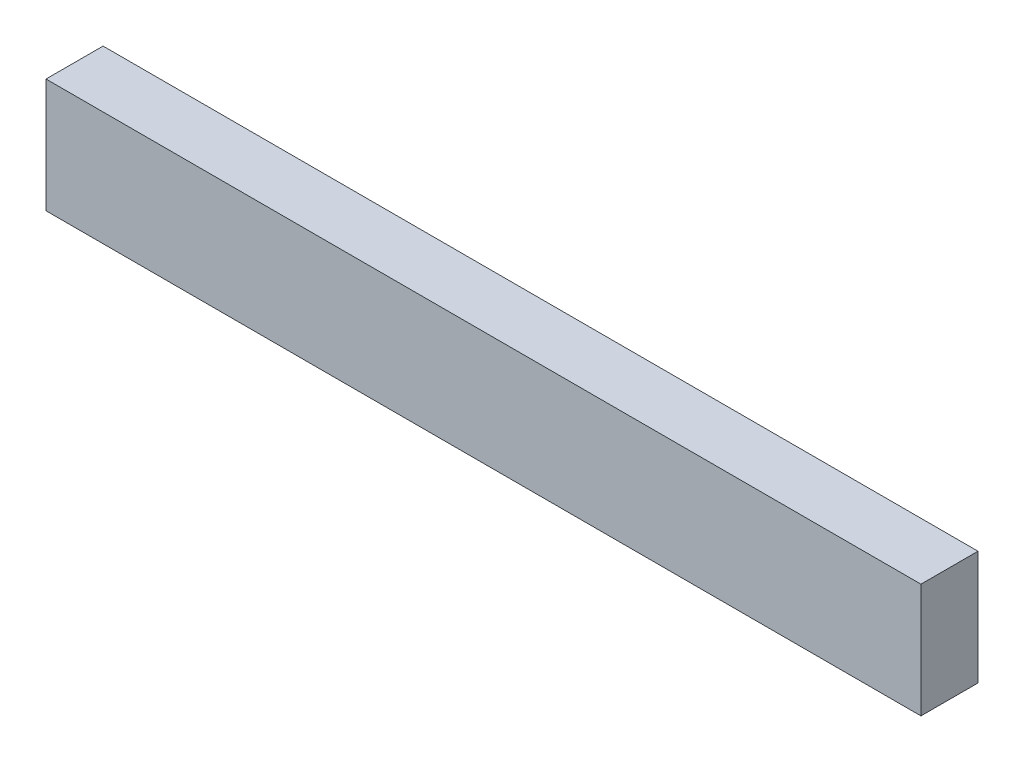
ISO-10303-21;
HEADER;
FILE_DESCRIPTION(('STEP AP214'),'2;1');
FILE_NAME('part.step','',(''),(''),'','','');
FILE_SCHEMA(('AUTOMOTIVE_DESIGN { 1 0 10303 214 1 1 1 1 }'));
ENDSEC;
DATA;
#1=APPLICATION_CONTEXT('core data for automotive mechanical design processes');
#2=APPLICATION_PROTOCOL_DEFINITION('international standard','automotive_design',2000,#1);
#3=PRODUCT_CONTEXT('',#1,'mechanical');
#4=PRODUCT('Part','Part','',(#3));
#5=PRODUCT_RELATED_PRODUCT_CATEGORY('part','',(#4));
#6=PRODUCT_DEFINITION_FORMATION('','',#4);
#7=PRODUCT_DEFINITION_CONTEXT('part definition',#1,'design');
#8=PRODUCT_DEFINITION('design','',#6,#7);
#9=PRODUCT_DEFINITION_SHAPE('','',#8);
#10=(LENGTH_UNIT() NAMED_UNIT(*) SI_UNIT(.MILLI.,.METRE.));
#11=(NAMED_UNIT(*) PLANE_ANGLE_UNIT() SI_UNIT($,.RADIAN.));
#12=(NAMED_UNIT(*) SI_UNIT($,.STERADIAN.) SOLID_ANGLE_UNIT());
#13=UNCERTAINTY_MEASURE_WITH_UNIT(LENGTH_MEASURE(1.E-05),#10,'distance_accuracy_value','');
#14=(GEOMETRIC_REPRESENTATION_CONTEXT(3) GLOBAL_UNCERTAINTY_ASSIGNED_CONTEXT((#13)) GLOBAL_UNIT_ASSIGNED_CONTEXT((#10,
#11,#12)) REPRESENTATION_CONTEXT('',''));
#15=CARTESIAN_POINT('',(0.,0.,0.));
#16=DIRECTION('',(0.,0.,1.));
#17=DIRECTION('',(1.,0.,0.));
#18=AXIS2_PLACEMENT_3D('',#15,#16,#17);
#19=CARTESIAN_POINT('',(2.88650657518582,0.,1.5));
#20=DIRECTION('',(1.,0.,0.));
#21=DIRECTION('',(0.,0.,-1.));
#22=AXIS2_PLACEMENT_3D('',#19,#20,#21);
#23=PLANE('',#22);
#24=DIRECTION('',(0.,-1.,0.));
#25=VECTOR('',#24,1.);
#26=CARTESIAN_POINT('',(2.88650657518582,0.,0.));
#27=LINE('',#26,#25);
#28=CARTESIAN_POINT('',(2.88650657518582,3.,0.));
#29=VERTEX_POINT('',#28);
#30=CARTESIAN_POINT('',(2.88650657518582,0.,0.));
#31=VERTEX_POINT('',#30);
#32=EDGE_CURVE('E96',#29,#31,#27,.T.);
#33=ORIENTED_EDGE('',*,*,#32,.T.);
#34=DIRECTION('',(0.,0.,-1.));
#35=VECTOR('',#34,1.);
#36=CARTESIAN_POINT('',(2.88650657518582,0.,1.5));
#37=LINE('',#36,#35);
#38=CARTESIAN_POINT('',(2.88650657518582,0.,1.5));
#39=VERTEX_POINT('',#38);
#40=EDGE_CURVE('E11',#39,#31,#37,.T.);
#41=ORIENTED_EDGE('',*,*,#40,.F.);
#42=DIRECTION('',(0.,-1.,0.));
#43=VECTOR('',#42,1.);
#44=CARTESIAN_POINT('',(2.88650657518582,0.,1.5));
#45=LINE('',#44,#43);
#46=CARTESIAN_POINT('',(2.88650657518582,3.,1.5));
#47=VERTEX_POINT('',#46);
#48=EDGE_CURVE('E84',#47,#39,#45,.T.);
#49=ORIENTED_EDGE('',*,*,#48,.F.);
#50=DIRECTION('',(0.,0.,-1.));
#51=VECTOR('',#50,1.);
#52=CARTESIAN_POINT('',(2.88650657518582,3.,1.5));
#53=LINE('',#52,#51);
#54=EDGE_CURVE('E92',#47,#29,#53,.T.);
#55=ORIENTED_EDGE('',*,*,#54,.T.);
#56=EDGE_LOOP('',(#33,#41,#49,#55));
#57=FACE_BOUND('',#56,.T.);
#58=ADVANCED_FACE('F33',(#57),#23,.F.);
#59=CARTESIAN_POINT('',(2.88650657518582,0.,1.5));
#60=DIRECTION('',(0.,1.,0.));
#61=DIRECTION('',(0.,0.,1.));
#62=AXIS2_PLACEMENT_3D('',#59,#60,#61);
#63=PLANE('',#62);
#64=DIRECTION('',(1.,0.,0.));
#65=VECTOR('',#64,1.);
#66=CARTESIAN_POINT('',(2.88650657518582,0.,0.));
#67=LINE('',#66,#65);
#68=CARTESIAN_POINT('',(25.8865065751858,0.,0.));
#69=VERTEX_POINT('',#68);
#70=EDGE_CURVE('E88',#31,#69,#67,.T.);
#71=ORIENTED_EDGE('',*,*,#70,.T.);
#72=DIRECTION('',(0.,0.,-1.));
#73=VECTOR('',#72,1.);
#74=CARTESIAN_POINT('',(25.8865065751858,0.,1.5));
#75=LINE('',#74,#73);
#76=CARTESIAN_POINT('',(25.8865065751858,0.,1.5));
#77=VERTEX_POINT('',#76);
#78=EDGE_CURVE('E41',#77,#69,#75,.T.);
#79=ORIENTED_EDGE('',*,*,#78,.F.);
#80=DIRECTION('',(1.,0.,0.));
#81=VECTOR('',#80,1.);
#82=CARTESIAN_POINT('',(2.88650657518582,0.,1.5));
#83=LINE('',#82,#81);
#84=EDGE_CURVE('E79',#39,#77,#83,.T.);
#85=ORIENTED_EDGE('',*,*,#84,.F.);
#86=ORIENTED_EDGE('',*,*,#40,.T.);
#87=EDGE_LOOP('',(#71,#79,#85,#86));
#88=FACE_BOUND('',#87,.T.);
#89=ADVANCED_FACE('F87',(#88),#63,.F.);
#90=CARTESIAN_POINT('',(25.8865065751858,0.,1.5));
#91=DIRECTION('',(-1.,0.,0.));
#92=DIRECTION('',(0.,0.,1.));
#93=AXIS2_PLACEMENT_3D('',#90,#91,#92);
#94=PLANE('',#93);
#95=DIRECTION('',(0.,1.,0.));
#96=VECTOR('',#95,1.);
#97=CARTESIAN_POINT('',(25.8865065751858,0.,0.));
#98=LINE('',#97,#96);
#99=CARTESIAN_POINT('',(25.8865065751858,3.,0.));
#100=VERTEX_POINT('',#99);
#101=EDGE_CURVE('E66',#69,#100,#98,.T.);
#102=ORIENTED_EDGE('',*,*,#101,.T.);
#103=DIRECTION('',(0.,0.,-1.));
#104=VECTOR('',#103,1.);
#105=CARTESIAN_POINT('',(25.8865065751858,3.,1.5));
#106=LINE('',#105,#104);
#107=CARTESIAN_POINT('',(25.8865065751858,3.,1.5));
#108=VERTEX_POINT('',#107);
#109=EDGE_CURVE('E89',#108,#100,#106,.T.);
#110=ORIENTED_EDGE('',*,*,#109,.F.);
#111=DIRECTION('',(0.,1.,0.));
#112=VECTOR('',#111,1.);
#113=CARTESIAN_POINT('',(25.8865065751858,0.,1.5));
#114=LINE('',#113,#112);
#115=EDGE_CURVE('E82',#77,#108,#114,.T.);
#116=ORIENTED_EDGE('',*,*,#115,.F.);
#117=ORIENTED_EDGE('',*,*,#78,.T.);
#118=EDGE_LOOP('',(#102,#110,#116,#117));
#119=FACE_BOUND('',#118,.T.);
#120=ADVANCED_FACE('F90',(#119),#94,.F.);
#121=CARTESIAN_POINT('',(2.88650657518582,3.,1.5));
#122=DIRECTION('',(0.,-1.,0.));
#123=DIRECTION('',(0.,0.,-1.));
#124=AXIS2_PLACEMENT_3D('',#121,#122,#123);
#125=PLANE('',#124);
#126=DIRECTION('',(-1.,0.,0.));
#127=VECTOR('',#126,1.);
#128=CARTESIAN_POINT('',(2.88650657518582,3.,0.));
#129=LINE('',#128,#127);
#130=EDGE_CURVE('E72',#100,#29,#129,.T.);
#131=ORIENTED_EDGE('',*,*,#130,.T.);
#132=ORIENTED_EDGE('',*,*,#54,.F.);
#133=DIRECTION('',(-1.,0.,0.));
#134=VECTOR('',#133,1.);
#135=CARTESIAN_POINT('',(2.88650657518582,3.,1.5));
#136=LINE('',#135,#134);
#137=EDGE_CURVE('E49',#108,#47,#136,.T.);
#138=ORIENTED_EDGE('',*,*,#137,.F.);
#139=ORIENTED_EDGE('',*,*,#109,.T.);
#140=EDGE_LOOP('',(#131,#132,#138,#139));
#141=FACE_BOUND('',#140,.T.);
#142=ADVANCED_FACE('F103',(#141),#125,.F.);
#143=CARTESIAN_POINT('',(0.,0.,1.5));
#144=DIRECTION('',(0.,0.,-1.));
#145=DIRECTION('',(-1.,0.,0.));
#146=AXIS2_PLACEMENT_3D('',#143,#144,#145);
#147=PLANE('',#146);
#148=ORIENTED_EDGE('',*,*,#48,.T.);
#149=ORIENTED_EDGE('',*,*,#84,.T.);
#150=ORIENTED_EDGE('',*,*,#115,.T.);
#151=ORIENTED_EDGE('',*,*,#137,.T.);
#152=EDGE_LOOP('',(#148,#149,#150,#151));
#153=FACE_BOUND('',#152,.T.);
#154=ADVANCED_FACE('F80',(#153),#147,.F.);
#155=CARTESIAN_POINT('',(0.,0.,0.));
#156=DIRECTION('',(0.,0.,-1.));
#157=DIRECTION('',(-1.,0.,0.));
#158=AXIS2_PLACEMENT_3D('',#155,#156,#157);
#159=PLANE('',#158);
#160=ORIENTED_EDGE('',*,*,#32,.F.);
#161=ORIENTED_EDGE('',*,*,#130,.F.);
#162=ORIENTED_EDGE('',*,*,#101,.F.);
#163=ORIENTED_EDGE('',*,*,#70,.F.);
#164=EDGE_LOOP('',(#160,#161,#162,#163));
#165=FACE_BOUND('',#164,.T.);
#166=ADVANCED_FACE('F106',(#165),#159,.T.);
#167=CLOSED_SHELL('',(#58,#89,#120,#142,#154,#166));
#168=MANIFOLD_SOLID_BREP('B2',#167);
#169=ADVANCED_BREP_SHAPE_REPRESENTATION('',(#18,#168),#14);
#170=SHAPE_DEFINITION_REPRESENTATION(#9,#169);
ENDSEC;
END-ISO-10303-21;
